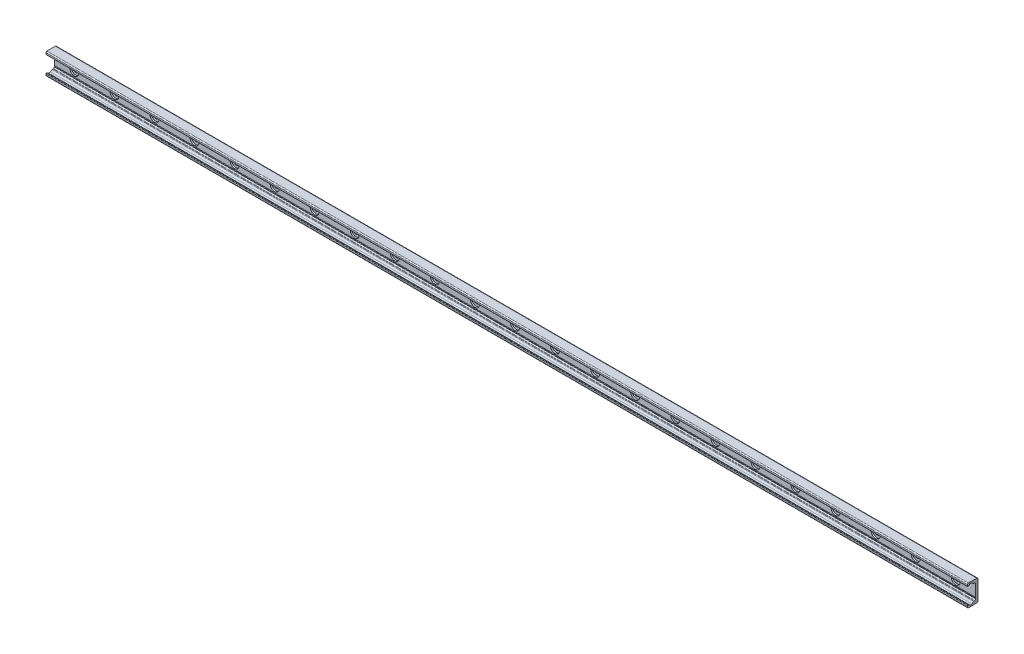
from build123d import *

# Parameters (mm, degrees)
BOSS_EXTRUDE1_DEPTH = 920
SKETCH2_R           = 9
SKETCH2_R_2         = 4.5
CUT_EXTRUDE1_DEPTH  = 3.1
SKETCH2_2_R         = 4.5
CUT_EXTRUDE2_DEPTH  = 921.399098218
LPATTERN1_COUNT     = 23
LPATTERN1_PITCH     = 80


with BuildPart() as part:
    # Sketch1 → Boss-Extrude1 (new, symmetric)
    with BuildSketch(Plane(origin=(0, 0, 0), x_dir=(0, 0, -1), z_dir=(1, 0, 0))):
        with BuildLine():
            Line((0, 0), (0, 19))
            ThreePointArc((0, 19), (-0.732233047, 20.767766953), (-2.5, 21.5))
            Line((-2.5, 21.5), (-19, 21.5))
            ThreePointArc((-19, 21.5), (-20.414213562, 20.914213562), (-21, 19.5))
            Line((-21, 19.5), (-21, 16.625057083))
            ThreePointArc((-21, 16.625057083), (-20.553251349, 15.888838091), (-19.693931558, 15.945160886))
            Line((-19.693931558, 15.945160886), (-16.794305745, 17.975500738))
            ThreePointArc((-16.794305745, 17.975500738), (-14.5, 18.69889256), (-12.205694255, 17.975500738))
            Line((-12.205694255, 17.975500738), (-8.829831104, 15.611695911))
            ThreePointArc((-8.829831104, 15.611695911), (-8.28408983, 15.342566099), (-7.682678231, 15.25))
            Line((-7.682678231, 15.25), (-6.5, 15.25))
            ThreePointArc((-6.5, 15.25), (-5.085786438, 14.664213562), (-4.5, 13.25))
            Line((-4.5, 13.25), (-4.5, -10.75))
            ThreePointArc((-4.5, -10.75), (-4.25, -11), (-4.5, -11.25))
            Line((-4.5, -11.25), (-4.5, -12.25))
            ThreePointArc((-4.5, -12.25), (-4.25, -12.5), (-4.5, -12.75))
            Line((-4.5, -12.75), (-4.5, -13.25))
            ThreePointArc((-4.5, -13.25), (-5.085786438, -14.664213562), (-6.5, -15.25))
            Line((-6.5, -15.25), (-7.682678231, -15.25))
            ThreePointArc((-7.682678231, -15.25), (-8.28408983, -15.342566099), (-8.829831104, -15.611695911))
            Line((-8.829831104, -15.611695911), (-12.205694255, -17.975500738))
            ThreePointArc((-12.205694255, -17.975500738), (-14.5, -18.69889256), (-16.794305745, -17.975500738))
            Line((-16.794305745, -17.975500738), (-19.693931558, -15.945160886))
            ThreePointArc((-19.693931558, -15.945160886), (-20.553251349, -15.888838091), (-21, -16.625057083))
            Line((-21, -16.625057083), (-21, -19.5))
            ThreePointArc((-21, -19.5), (-20.414213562, -20.914213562), (-19, -21.5))
            Line((-19, -21.5), (-2.5, -21.5))
            ThreePointArc((-2.5, -21.5), (-0.732233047, -20.767766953), (0, -19))
            Line((0, -19), (0, 0))
        make_face()
    extrude(amount=BOSS_EXTRUDE1_DEPTH, both=True)

    # Sketch2 → Cut-Extrude1 (cut)
    with BuildSketch(Plane.XY.offset(4.5)):
        with Locations((880, 0)):
            Circle(SKETCH2_R)
        with Locations((880, 0)):
            Circle(SKETCH2_R_2, mode=Mode.SUBTRACT)
    cut_extrude1 = extrude(amount=-CUT_EXTRUDE1_DEPTH, mode=Mode.SUBTRACT)

    # Sketch2_2 → Cut-Extrude2 (cut, through all)
    with BuildSketch(Plane.XY.offset(4.5)):
        with Locations((880, 0)):
            Circle(SKETCH2_2_R)
    cut_extrude2 = extrude(amount=-CUT_EXTRUDE2_DEPTH, mode=Mode.SUBTRACT)

    # LPattern1: Cut-Extrude1, Cut-Extrude2 ×23
    with Locations(*[(-i * LPATTERN1_PITCH, 0, 0) for i in range(1, LPATTERN1_COUNT)]):
        add(cut_extrude1, mode=Mode.SUBTRACT)
        add(cut_extrude2, mode=Mode.SUBTRACT)


solid = part.part
